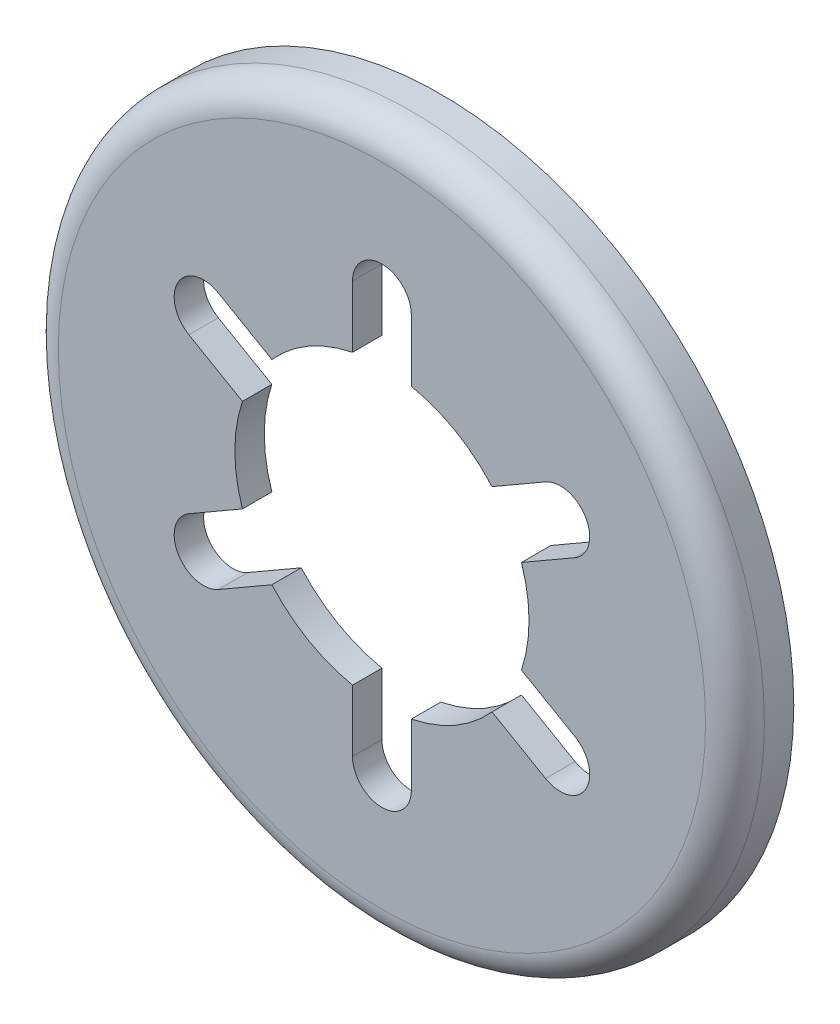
ISO-10303-21;
HEADER;
FILE_DESCRIPTION(('STEP AP214'),'2;1');
FILE_NAME('part.step','',(''),(''),'','','');
FILE_SCHEMA(('AUTOMOTIVE_DESIGN { 1 0 10303 214 1 1 1 1 }'));
ENDSEC;
DATA;
#1=APPLICATION_CONTEXT('core data for automotive mechanical design processes');
#2=APPLICATION_PROTOCOL_DEFINITION('international standard','automotive_design',2000,#1);
#3=PRODUCT_CONTEXT('',#1,'mechanical');
#4=PRODUCT('Part','Part','',(#3));
#5=PRODUCT_RELATED_PRODUCT_CATEGORY('part','',(#4));
#6=PRODUCT_DEFINITION_FORMATION('','',#4);
#7=PRODUCT_DEFINITION_CONTEXT('part definition',#1,'design');
#8=PRODUCT_DEFINITION('design','',#6,#7);
#9=PRODUCT_DEFINITION_SHAPE('','',#8);
#10=(LENGTH_UNIT() NAMED_UNIT(*) SI_UNIT(.MILLI.,.METRE.));
#11=(NAMED_UNIT(*) PLANE_ANGLE_UNIT() SI_UNIT($,.RADIAN.));
#12=(NAMED_UNIT(*) SI_UNIT($,.STERADIAN.) SOLID_ANGLE_UNIT());
#13=UNCERTAINTY_MEASURE_WITH_UNIT(LENGTH_MEASURE(1.E-05),#10,'distance_accuracy_value','');
#14=(GEOMETRIC_REPRESENTATION_CONTEXT(3) GLOBAL_UNCERTAINTY_ASSIGNED_CONTEXT((#13)) GLOBAL_UNIT_ASSIGNED_CONTEXT((#10,
#11,#12)) REPRESENTATION_CONTEXT('',''));
#15=CARTESIAN_POINT('',(0.,0.,0.));
#16=DIRECTION('',(0.,0.,1.));
#17=DIRECTION('',(1.,0.,0.));
#18=AXIS2_PLACEMENT_3D('',#15,#16,#17);
#19=CARTESIAN_POINT('',(0.,0.,1.));
#20=DIRECTION('',(0.,0.,-1.));
#21=DIRECTION('',(-1.,0.,0.));
#22=AXIS2_PLACEMENT_3D('',#19,#20,#21);
#23=CYLINDRICAL_SURFACE('',#22,2.5);
#24=DIRECTION('',(0.,0.,1.));
#25=VECTOR('',#24,1.);
#26=CARTESIAN_POINT('',(-1.87132034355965,1.6577575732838,0.));
#27=LINE('',#26,#25);
#28=CARTESIAN_POINT('',(-1.87132034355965,1.6577575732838,0.5));
#29=VERTEX_POINT('',#28);
#30=CARTESIAN_POINT('',(-1.87132034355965,1.6577575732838,1.));
#31=VERTEX_POINT('',#30);
#32=EDGE_CURVE('E214',#29,#31,#27,.T.);
#33=ORIENTED_EDGE('',*,*,#32,.F.);
#34=CARTESIAN_POINT('',(0.,0.,0.5));
#35=DIRECTION('',(0.,0.,-1.));
#36=DIRECTION('',(-1.,0.,0.));
#37=AXIS2_PLACEMENT_3D('',#34,#35,#36);
#38=CIRCLE('',#37,2.5);
#39=CARTESIAN_POINT('',(-0.5,2.44948974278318,0.5));
#40=VERTEX_POINT('',#39);
#41=EDGE_CURVE('E415',#29,#40,#38,.T.);
#42=ORIENTED_EDGE('',*,*,#41,.T.);
#43=DIRECTION('',(0.,0.,1.));
#44=VECTOR('',#43,1.);
#45=CARTESIAN_POINT('',(-0.5,2.44948974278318,0.));
#46=LINE('',#45,#44);
#47=CARTESIAN_POINT('',(-0.5,2.44948974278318,1.));
#48=VERTEX_POINT('',#47);
#49=EDGE_CURVE('E266',#40,#48,#46,.T.);
#50=ORIENTED_EDGE('',*,*,#49,.T.);
#51=CARTESIAN_POINT('',(0.,0.,1.));
#52=DIRECTION('',(0.,0.,1.));
#53=DIRECTION('',(1.,0.,0.));
#54=AXIS2_PLACEMENT_3D('',#51,#52,#53);
#55=CIRCLE('',#54,2.5);
#56=EDGE_CURVE('E309',#48,#31,#55,.T.);
#57=ORIENTED_EDGE('',*,*,#56,.T.);
#58=EDGE_LOOP('',(#33,#42,#50,#57));
#59=FACE_BOUND('',#58,.T.);
#60=ADVANCED_FACE('F30',(#59),#23,.F.);
#61=DIRECTION('',(0.,0.,1.));
#62=VECTOR('',#61,1.);
#63=CARTESIAN_POINT('',(-2.37132034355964,-0.791732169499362,0.));
#64=LINE('',#63,#62);
#65=CARTESIAN_POINT('',(-2.37132034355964,-0.791732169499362,0.5));
#66=VERTEX_POINT('',#65);
#67=CARTESIAN_POINT('',(-2.37132034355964,-0.791732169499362,1.));
#68=VERTEX_POINT('',#67);
#69=EDGE_CURVE('E207',#66,#68,#64,.T.);
#70=ORIENTED_EDGE('',*,*,#69,.F.);
#71=CARTESIAN_POINT('',(0.,0.,0.5));
#72=DIRECTION('',(0.,0.,-1.));
#73=DIRECTION('',(-1.,0.,0.));
#74=AXIS2_PLACEMENT_3D('',#71,#72,#73);
#75=CIRCLE('',#74,2.5);
#76=CARTESIAN_POINT('',(-2.37132034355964,0.791732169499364,0.5));
#77=VERTEX_POINT('',#76);
#78=EDGE_CURVE('E193',#66,#77,#75,.T.);
#79=ORIENTED_EDGE('',*,*,#78,.T.);
#80=DIRECTION('',(0.,0.,1.));
#81=VECTOR('',#80,1.);
#82=CARTESIAN_POINT('',(-2.37132034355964,0.791732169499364,0.));
#83=LINE('',#82,#81);
#84=CARTESIAN_POINT('',(-2.37132034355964,0.791732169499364,1.));
#85=VERTEX_POINT('',#84);
#86=EDGE_CURVE('E205',#77,#85,#83,.T.);
#87=ORIENTED_EDGE('',*,*,#86,.T.);
#88=EDGE_CURVE('E310',#85,#68,#55,.T.);
#89=ORIENTED_EDGE('',*,*,#88,.T.);
#90=EDGE_LOOP('',(#70,#79,#87,#89));
#91=FACE_BOUND('',#90,.T.);
#92=ADVANCED_FACE('F203',(#91),#23,.F.);
#93=DIRECTION('',(0.,0.,1.));
#94=VECTOR('',#93,1.);
#95=CARTESIAN_POINT('',(-0.5,-2.44948974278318,0.));
#96=LINE('',#95,#94);
#97=CARTESIAN_POINT('',(-0.5,-2.44948974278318,0.5));
#98=VERTEX_POINT('',#97);
#99=CARTESIAN_POINT('',(-0.5,-2.44948974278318,1.));
#100=VERTEX_POINT('',#99);
#101=EDGE_CURVE('E252',#98,#100,#96,.T.);
#102=ORIENTED_EDGE('',*,*,#101,.F.);
#103=CARTESIAN_POINT('',(0.,0.,0.5));
#104=DIRECTION('',(0.,0.,-1.));
#105=DIRECTION('',(-1.,0.,0.));
#106=AXIS2_PLACEMENT_3D('',#103,#104,#105);
#107=CIRCLE('',#106,2.5);
#108=CARTESIAN_POINT('',(-1.87132034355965,-1.6577575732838,0.5));
#109=VERTEX_POINT('',#108);
#110=EDGE_CURVE('E370',#98,#109,#107,.T.);
#111=ORIENTED_EDGE('',*,*,#110,.T.);
#112=DIRECTION('',(0.,0.,1.));
#113=VECTOR('',#112,1.);
#114=CARTESIAN_POINT('',(-1.87132034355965,-1.6577575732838,0.));
#115=LINE('',#114,#113);
#116=CARTESIAN_POINT('',(-1.87132034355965,-1.6577575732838,1.));
#117=VERTEX_POINT('',#116);
#118=EDGE_CURVE('E237',#109,#117,#115,.T.);
#119=ORIENTED_EDGE('',*,*,#118,.T.);
#120=EDGE_CURVE('E346',#117,#100,#55,.T.);
#121=ORIENTED_EDGE('',*,*,#120,.T.);
#122=EDGE_LOOP('',(#102,#111,#119,#121));
#123=FACE_BOUND('',#122,.T.);
#124=ADVANCED_FACE('F357',(#123),#23,.F.);
#125=DIRECTION('',(0.,0.,1.));
#126=VECTOR('',#125,1.);
#127=CARTESIAN_POINT('',(1.87132034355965,-1.6577575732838,0.));
#128=LINE('',#127,#126);
#129=CARTESIAN_POINT('',(1.87132034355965,-1.6577575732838,0.5));
#130=VERTEX_POINT('',#129);
#131=CARTESIAN_POINT('',(1.87132034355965,-1.6577575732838,1.));
#132=VERTEX_POINT('',#131);
#133=EDGE_CURVE('E285',#130,#132,#128,.T.);
#134=ORIENTED_EDGE('',*,*,#133,.F.);
#135=CARTESIAN_POINT('',(0.,0.,0.5));
#136=DIRECTION('',(0.,0.,-1.));
#137=DIRECTION('',(-1.,0.,0.));
#138=AXIS2_PLACEMENT_3D('',#135,#136,#137);
#139=CIRCLE('',#138,2.5);
#140=CARTESIAN_POINT('',(0.5,-2.44948974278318,0.5));
#141=VERTEX_POINT('',#140);
#142=EDGE_CURVE('E386',#130,#141,#139,.T.);
#143=ORIENTED_EDGE('',*,*,#142,.T.);
#144=DIRECTION('',(0.,0.,1.));
#145=VECTOR('',#144,1.);
#146=CARTESIAN_POINT('',(0.5,-2.44948974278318,0.));
#147=LINE('',#146,#145);
#148=CARTESIAN_POINT('',(0.5,-2.44948974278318,1.));
#149=VERTEX_POINT('',#148);
#150=EDGE_CURVE('E254',#141,#149,#147,.T.);
#151=ORIENTED_EDGE('',*,*,#150,.T.);
#152=EDGE_CURVE('E345',#149,#132,#55,.T.);
#153=ORIENTED_EDGE('',*,*,#152,.T.);
#154=EDGE_LOOP('',(#134,#143,#151,#153));
#155=FACE_BOUND('',#154,.T.);
#156=ADVANCED_FACE('F466',(#155),#23,.F.);
#157=DIRECTION('',(0.,0.,1.));
#158=VECTOR('',#157,1.);
#159=CARTESIAN_POINT('',(0.5,2.44948974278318,0.));
#160=LINE('',#159,#158);
#161=CARTESIAN_POINT('',(0.5,2.44948974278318,0.5));
#162=VERTEX_POINT('',#161);
#163=CARTESIAN_POINT('',(0.5,2.44948974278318,1.));
#164=VERTEX_POINT('',#163);
#165=EDGE_CURVE('E265',#162,#164,#160,.T.);
#166=ORIENTED_EDGE('',*,*,#165,.F.);
#167=CARTESIAN_POINT('',(0.,0.,0.5));
#168=DIRECTION('',(0.,0.,-1.));
#169=DIRECTION('',(-1.,0.,0.));
#170=AXIS2_PLACEMENT_3D('',#167,#168,#169);
#171=CIRCLE('',#170,2.5);
#172=CARTESIAN_POINT('',(1.87132034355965,1.6577575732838,0.5));
#173=VERTEX_POINT('',#172);
#174=EDGE_CURVE('E383',#162,#173,#171,.T.);
#175=ORIENTED_EDGE('',*,*,#174,.T.);
#176=DIRECTION('',(0.,0.,1.));
#177=VECTOR('',#176,1.);
#178=CARTESIAN_POINT('',(1.87132034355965,1.6577575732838,0.));
#179=LINE('',#178,#177);
#180=CARTESIAN_POINT('',(1.87132034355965,1.6577575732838,1.));
#181=VERTEX_POINT('',#180);
#182=EDGE_CURVE('E303',#173,#181,#179,.T.);
#183=ORIENTED_EDGE('',*,*,#182,.T.);
#184=EDGE_CURVE('E306',#181,#164,#55,.T.);
#185=ORIENTED_EDGE('',*,*,#184,.T.);
#186=EDGE_LOOP('',(#166,#175,#183,#185));
#187=FACE_BOUND('',#186,.T.);
#188=ADVANCED_FACE('F434',(#187),#23,.F.);
#189=DIRECTION('',(0.,0.,1.));
#190=VECTOR('',#189,1.);
#191=CARTESIAN_POINT('',(2.37132034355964,0.791732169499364,0.));
#192=LINE('',#191,#190);
#193=CARTESIAN_POINT('',(2.37132034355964,0.791732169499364,0.5));
#194=VERTEX_POINT('',#193);
#195=CARTESIAN_POINT('',(2.37132034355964,0.791732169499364,1.));
#196=VERTEX_POINT('',#195);
#197=EDGE_CURVE('E301',#194,#196,#192,.T.);
#198=ORIENTED_EDGE('',*,*,#197,.F.);
#199=CARTESIAN_POINT('',(0.,0.,0.5));
#200=DIRECTION('',(0.,0.,-1.));
#201=DIRECTION('',(-1.,0.,0.));
#202=AXIS2_PLACEMENT_3D('',#199,#200,#201);
#203=CIRCLE('',#202,2.5);
#204=CARTESIAN_POINT('',(2.37132034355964,-0.791732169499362,0.5));
#205=VERTEX_POINT('',#204);
#206=EDGE_CURVE('E401',#194,#205,#203,.T.);
#207=ORIENTED_EDGE('',*,*,#206,.T.);
#208=DIRECTION('',(0.,0.,1.));
#209=VECTOR('',#208,1.);
#210=CARTESIAN_POINT('',(2.37132034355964,-0.791732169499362,0.));
#211=LINE('',#210,#209);
#212=CARTESIAN_POINT('',(2.37132034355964,-0.791732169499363,1.));
#213=VERTEX_POINT('',#212);
#214=EDGE_CURVE('E53',#205,#213,#211,.T.);
#215=ORIENTED_EDGE('',*,*,#214,.T.);
#216=EDGE_CURVE('E300',#213,#196,#55,.T.);
#217=ORIENTED_EDGE('',*,*,#216,.T.);
#218=EDGE_LOOP('',(#198,#207,#215,#217));
#219=FACE_BOUND('',#218,.T.);
#220=ADVANCED_FACE('F454',(#219),#23,.F.);
#221=CARTESIAN_POINT('',(3.03108891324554,1.74999999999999,0.));
#222=DIRECTION('',(0.,0.,1.));
#223=DIRECTION('',(1.,0.,0.));
#224=AXIS2_PLACEMENT_3D('',#221,#222,#223);
#225=CYLINDRICAL_SURFACE('',#224,0.5);
#226=CARTESIAN_POINT('',(3.03108891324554,1.74999999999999,0.5));
#227=DIRECTION('',(0.,0.,-1.));
#228=DIRECTION('',(-1.,0.,0.));
#229=AXIS2_PLACEMENT_3D('',#226,#227,#228);
#230=CIRCLE('',#229,0.5);
#231=CARTESIAN_POINT('',(3.28108891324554,1.31698729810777,0.5));
#232=VERTEX_POINT('',#231);
#233=CARTESIAN_POINT('',(2.78108891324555,2.18301270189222,0.5));
#234=VERTEX_POINT('',#233);
#235=EDGE_CURVE('E395',#232,#234,#230,.F.);
#236=ORIENTED_EDGE('',*,*,#235,.F.);
#237=DIRECTION('',(0.,0.,1.));
#238=VECTOR('',#237,1.);
#239=CARTESIAN_POINT('',(3.28108891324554,1.31698729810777,0.));
#240=LINE('',#239,#238);
#241=CARTESIAN_POINT('',(3.28108891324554,1.31698729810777,1.));
#242=VERTEX_POINT('',#241);
#243=EDGE_CURVE('E298',#232,#242,#240,.T.);
#244=ORIENTED_EDGE('',*,*,#243,.T.);
#245=CARTESIAN_POINT('',(3.03108891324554,1.74999999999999,1.));
#246=DIRECTION('',(0.,0.,1.));
#247=DIRECTION('',(1.,0.,0.));
#248=AXIS2_PLACEMENT_3D('',#245,#246,#247);
#249=CIRCLE('',#248,0.5);
#250=CARTESIAN_POINT('',(2.78108891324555,2.18301270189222,1.));
#251=VERTEX_POINT('',#250);
#252=EDGE_CURVE('E284',#242,#251,#249,.T.);
#253=ORIENTED_EDGE('',*,*,#252,.T.);
#254=DIRECTION('',(0.,0.,1.));
#255=VECTOR('',#254,1.);
#256=CARTESIAN_POINT('',(2.78108891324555,2.18301270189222,0.));
#257=LINE('',#256,#255);
#258=EDGE_CURVE('E297',#234,#251,#257,.T.);
#259=ORIENTED_EDGE('',*,*,#258,.F.);
#260=EDGE_LOOP('',(#236,#244,#253,#259));
#261=FACE_BOUND('',#260,.T.);
#262=ADVANCED_FACE('F445',(#261),#225,.F.);
#263=CARTESIAN_POINT('',(2.37132034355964,0.791732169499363,0.));
#264=DIRECTION('',(0.499999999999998,-0.86602540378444,0.));
#265=DIRECTION('',(0.86602540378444,0.499999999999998,0.));
#266=AXIS2_PLACEMENT_3D('',#263,#264,#265);
#267=PLANE('',#266);
#268=DIRECTION('',(0.86602540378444,0.499999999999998,0.));
#269=VECTOR('',#268,1.);
#270=CARTESIAN_POINT('',(2.37132034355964,0.791732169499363,0.5));
#271=LINE('',#270,#269);
#272=EDGE_CURVE('E399',#194,#232,#271,.T.);
#273=ORIENTED_EDGE('',*,*,#272,.F.);
#274=ORIENTED_EDGE('',*,*,#197,.T.);
#275=DIRECTION('',(0.86602540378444,0.499999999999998,0.));
#276=VECTOR('',#275,1.);
#277=CARTESIAN_POINT('',(2.37132034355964,0.791732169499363,1.));
#278=LINE('',#277,#276);
#279=EDGE_CURVE('E294',#196,#242,#278,.T.);
#280=ORIENTED_EDGE('',*,*,#279,.T.);
#281=ORIENTED_EDGE('',*,*,#243,.F.);
#282=EDGE_LOOP('',(#273,#274,#280,#281));
#283=FACE_BOUND('',#282,.T.);
#284=ADVANCED_FACE('F449',(#283),#267,.F.);
#285=CARTESIAN_POINT('',(1.87132034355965,1.6577575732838,0.));
#286=DIRECTION('',(-0.499999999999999,0.866025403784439,0.));
#287=DIRECTION('',(-0.866025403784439,-0.499999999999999,0.));
#288=AXIS2_PLACEMENT_3D('',#285,#286,#287);
#289=PLANE('',#288);
#290=DIRECTION('',(-0.866025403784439,-0.499999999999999,0.));
#291=VECTOR('',#290,1.);
#292=CARTESIAN_POINT('',(1.87132034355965,1.6577575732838,0.5));
#293=LINE('',#292,#291);
#294=EDGE_CURVE('E393',#234,#173,#293,.T.);
#295=ORIENTED_EDGE('',*,*,#294,.F.);
#296=ORIENTED_EDGE('',*,*,#258,.T.);
#297=DIRECTION('',(-0.866025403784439,-0.499999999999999,0.));
#298=VECTOR('',#297,1.);
#299=CARTESIAN_POINT('',(1.87132034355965,1.6577575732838,1.));
#300=LINE('',#299,#298);
#301=EDGE_CURVE('E291',#251,#181,#300,.T.);
#302=ORIENTED_EDGE('',*,*,#301,.T.);
#303=ORIENTED_EDGE('',*,*,#182,.F.);
#304=EDGE_LOOP('',(#295,#296,#302,#303));
#305=FACE_BOUND('',#304,.T.);
#306=ADVANCED_FACE('F441',(#305),#289,.F.);
#307=CARTESIAN_POINT('',(3.03108891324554,-1.74999999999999,0.));
#308=DIRECTION('',(0.,0.,1.));
#309=DIRECTION('',(1.,0.,0.));
#310=AXIS2_PLACEMENT_3D('',#307,#308,#309);
#311=CYLINDRICAL_SURFACE('',#310,0.5);
#312=CARTESIAN_POINT('',(3.03108891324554,-1.74999999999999,0.5));
#313=DIRECTION('',(0.,0.,-1.));
#314=DIRECTION('',(-1.,0.,0.));
#315=AXIS2_PLACEMENT_3D('',#312,#313,#314);
#316=CIRCLE('',#315,0.5);
#317=CARTESIAN_POINT('',(2.78108891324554,-2.18301270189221,0.5));
#318=VERTEX_POINT('',#317);
#319=CARTESIAN_POINT('',(3.28108891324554,-1.31698729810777,0.5));
#320=VERTEX_POINT('',#319);
#321=EDGE_CURVE('E391',#318,#320,#316,.F.);
#322=ORIENTED_EDGE('',*,*,#321,.F.);
#323=DIRECTION('',(0.,0.,1.));
#324=VECTOR('',#323,1.);
#325=CARTESIAN_POINT('',(2.78108891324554,-2.18301270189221,0.));
#326=LINE('',#325,#324);
#327=CARTESIAN_POINT('',(2.78108891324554,-2.18301270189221,1.));
#328=VERTEX_POINT('',#327);
#329=EDGE_CURVE('E282',#318,#328,#326,.T.);
#330=ORIENTED_EDGE('',*,*,#329,.T.);
#331=CARTESIAN_POINT('',(3.03108891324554,-1.74999999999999,1.));
#332=DIRECTION('',(0.,0.,1.));
#333=DIRECTION('',(1.,0.,0.));
#334=AXIS2_PLACEMENT_3D('',#331,#332,#333);
#335=CIRCLE('',#334,0.5);
#336=CARTESIAN_POINT('',(3.28108891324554,-1.31698729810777,1.));
#337=VERTEX_POINT('',#336);
#338=EDGE_CURVE('E268',#328,#337,#335,.T.);
#339=ORIENTED_EDGE('',*,*,#338,.T.);
#340=DIRECTION('',(0.,0.,1.));
#341=VECTOR('',#340,1.);
#342=CARTESIAN_POINT('',(3.28108891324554,-1.31698729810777,0.));
#343=LINE('',#342,#341);
#344=EDGE_CURVE('E281',#320,#337,#343,.T.);
#345=ORIENTED_EDGE('',*,*,#344,.F.);
#346=EDGE_LOOP('',(#322,#330,#339,#345));
#347=FACE_BOUND('',#346,.T.);
#348=ADVANCED_FACE('F461',(#347),#311,.F.);
#349=CARTESIAN_POINT('',(1.87132034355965,-1.6577575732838,0.));
#350=DIRECTION('',(-0.499999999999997,-0.866025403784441,0.));
#351=DIRECTION('',(0.866025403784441,-0.499999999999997,0.));
#352=AXIS2_PLACEMENT_3D('',#349,#350,#351);
#353=PLANE('',#352);
#354=DIRECTION('',(0.866025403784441,-0.499999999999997,0.));
#355=VECTOR('',#354,1.);
#356=CARTESIAN_POINT('',(1.87132034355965,-1.6577575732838,0.5));
#357=LINE('',#356,#355);
#358=EDGE_CURVE('E389',#130,#318,#357,.T.);
#359=ORIENTED_EDGE('',*,*,#358,.F.);
#360=ORIENTED_EDGE('',*,*,#133,.T.);
#361=DIRECTION('',(0.86602540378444,-0.499999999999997,0.));
#362=VECTOR('',#361,1.);
#363=CARTESIAN_POINT('',(1.87132034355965,-1.6577575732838,1.));
#364=LINE('',#363,#362);
#365=EDGE_CURVE('E278',#132,#328,#364,.T.);
#366=ORIENTED_EDGE('',*,*,#365,.T.);
#367=ORIENTED_EDGE('',*,*,#329,.F.);
#368=EDGE_LOOP('',(#359,#360,#366,#367));
#369=FACE_BOUND('',#368,.T.);
#370=ADVANCED_FACE('F465',(#369),#353,.F.);
#371=CARTESIAN_POINT('',(2.37132034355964,-0.791732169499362,0.));
#372=DIRECTION('',(0.499999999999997,0.86602540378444,0.));
#373=DIRECTION('',(-0.86602540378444,0.499999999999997,0.));
#374=AXIS2_PLACEMENT_3D('',#371,#372,#373);
#375=PLANE('',#374);
#376=DIRECTION('',(-0.86602540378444,0.499999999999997,0.));
#377=VECTOR('',#376,1.);
#378=CARTESIAN_POINT('',(2.37132034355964,-0.791732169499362,0.5));
#379=LINE('',#378,#377);
#380=EDGE_CURVE('E397',#320,#205,#379,.T.);
#381=ORIENTED_EDGE('',*,*,#380,.F.);
#382=ORIENTED_EDGE('',*,*,#344,.T.);
#383=DIRECTION('',(-0.86602540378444,0.499999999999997,0.));
#384=VECTOR('',#383,1.);
#385=CARTESIAN_POINT('',(2.37132034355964,-0.791732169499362,1.));
#386=LINE('',#385,#384);
#387=EDGE_CURVE('E276',#337,#213,#386,.T.);
#388=ORIENTED_EDGE('',*,*,#387,.T.);
#389=ORIENTED_EDGE('',*,*,#214,.F.);
#390=EDGE_LOOP('',(#381,#382,#388,#389));
#391=FACE_BOUND('',#390,.T.);
#392=ADVANCED_FACE('F457',(#391),#375,.F.);
#393=CARTESIAN_POINT('',(-0.5,3.5,0.));
#394=DIRECTION('',(-1.,0.,0.));
#395=DIRECTION('',(0.,-1.,0.));
#396=AXIS2_PLACEMENT_3D('',#393,#394,#395);
#397=PLANE('',#396);
#398=DIRECTION('',(0.,-1.,0.));
#399=VECTOR('',#398,1.);
#400=CARTESIAN_POINT('',(-0.5,3.5,0.5));
#401=LINE('',#400,#399);
#402=CARTESIAN_POINT('',(-0.5,3.5,0.5));
#403=VERTEX_POINT('',#402);
#404=EDGE_CURVE('E374',#403,#40,#401,.T.);
#405=ORIENTED_EDGE('',*,*,#404,.F.);
#406=DIRECTION('',(0.,0.,1.));
#407=VECTOR('',#406,1.);
#408=CARTESIAN_POINT('',(-0.5,3.5,0.));
#409=LINE('',#408,#407);
#410=CARTESIAN_POINT('',(-0.5,3.5,1.));
#411=VERTEX_POINT('',#410);
#412=EDGE_CURVE('E269',#403,#411,#409,.T.);
#413=ORIENTED_EDGE('',*,*,#412,.T.);
#414=DIRECTION('',(0.,-1.,0.));
#415=VECTOR('',#414,1.);
#416=CARTESIAN_POINT('',(-0.5,3.5,1.));
#417=LINE('',#416,#415);
#418=EDGE_CURVE('E262',#411,#48,#417,.T.);
#419=ORIENTED_EDGE('',*,*,#418,.T.);
#420=ORIENTED_EDGE('',*,*,#49,.F.);
#421=EDGE_LOOP('',(#405,#413,#419,#420));
#422=FACE_BOUND('',#421,.T.);
#423=ADVANCED_FACE('F422',(#422),#397,.F.);
#424=CARTESIAN_POINT('',(0.,3.5,0.));
#425=DIRECTION('',(0.,0.,1.));
#426=DIRECTION('',(1.,0.,0.));
#427=AXIS2_PLACEMENT_3D('',#424,#425,#426);
#428=CYLINDRICAL_SURFACE('',#427,0.5);
#429=CARTESIAN_POINT('',(0.,3.5,0.5));
#430=DIRECTION('',(0.,0.,-1.));
#431=DIRECTION('',(-1.,0.,0.));
#432=AXIS2_PLACEMENT_3D('',#429,#430,#431);
#433=CIRCLE('',#432,0.5);
#434=CARTESIAN_POINT('',(0.5,3.5,0.5));
#435=VERTEX_POINT('',#434);
#436=EDGE_CURVE('E372',#435,#403,#433,.F.);
#437=ORIENTED_EDGE('',*,*,#436,.F.);
#438=DIRECTION('',(0.,0.,1.));
#439=VECTOR('',#438,1.);
#440=CARTESIAN_POINT('',(0.5,3.5,0.));
#441=LINE('',#440,#439);
#442=CARTESIAN_POINT('',(0.5,3.5,1.));
#443=VERTEX_POINT('',#442);
#444=EDGE_CURVE('E271',#435,#443,#441,.T.);
#445=ORIENTED_EDGE('',*,*,#444,.T.);
#446=CARTESIAN_POINT('',(0.,3.5,1.));
#447=DIRECTION('',(0.,0.,1.));
#448=DIRECTION('',(1.,0.,0.));
#449=AXIS2_PLACEMENT_3D('',#446,#447,#448);
#450=CIRCLE('',#449,0.5);
#451=EDGE_CURVE('E259',#443,#411,#450,.T.);
#452=ORIENTED_EDGE('',*,*,#451,.T.);
#453=ORIENTED_EDGE('',*,*,#412,.F.);
#454=EDGE_LOOP('',(#437,#445,#452,#453));
#455=FACE_BOUND('',#454,.T.);
#456=ADVANCED_FACE('F427',(#455),#428,.F.);
#457=CARTESIAN_POINT('',(0.5,3.5,0.));
#458=DIRECTION('',(1.,0.,0.));
#459=DIRECTION('',(0.,1.,0.));
#460=AXIS2_PLACEMENT_3D('',#457,#458,#459);
#461=PLANE('',#460);
#462=DIRECTION('',(0.,1.,0.));
#463=VECTOR('',#462,1.);
#464=CARTESIAN_POINT('',(0.5,3.5,0.5));
#465=LINE('',#464,#463);
#466=EDGE_CURVE('E381',#162,#435,#465,.T.);
#467=ORIENTED_EDGE('',*,*,#466,.F.);
#468=ORIENTED_EDGE('',*,*,#165,.T.);
#469=DIRECTION('',(0.,1.,0.));
#470=VECTOR('',#469,1.);
#471=CARTESIAN_POINT('',(0.5,3.5,1.));
#472=LINE('',#471,#470);
#473=EDGE_CURVE('E251',#164,#443,#472,.T.);
#474=ORIENTED_EDGE('',*,*,#473,.T.);
#475=ORIENTED_EDGE('',*,*,#444,.F.);
#476=EDGE_LOOP('',(#467,#468,#474,#475));
#477=FACE_BOUND('',#476,.T.);
#478=ADVANCED_FACE('F431',(#477),#461,.F.);
#479=CARTESIAN_POINT('',(0.,-3.5,0.));
#480=DIRECTION('',(0.,0.,1.));
#481=DIRECTION('',(1.,0.,0.));
#482=AXIS2_PLACEMENT_3D('',#479,#480,#481);
#483=CYLINDRICAL_SURFACE('',#482,0.5);
#484=CARTESIAN_POINT('',(0.,-3.5,0.5));
#485=DIRECTION('',(0.,0.,-1.));
#486=DIRECTION('',(-1.,0.,0.));
#487=AXIS2_PLACEMENT_3D('',#484,#485,#486);
#488=CIRCLE('',#487,0.5);
#489=CARTESIAN_POINT('',(-0.5,-3.5,0.5));
#490=VERTEX_POINT('',#489);
#491=CARTESIAN_POINT('',(0.5,-3.5,0.5));
#492=VERTEX_POINT('',#491);
#493=EDGE_CURVE('E369',#490,#492,#488,.F.);
#494=ORIENTED_EDGE('',*,*,#493,.F.);
#495=DIRECTION('',(0.,0.,1.));
#496=VECTOR('',#495,1.);
#497=CARTESIAN_POINT('',(-0.5,-3.5,0.));
#498=LINE('',#497,#496);
#499=CARTESIAN_POINT('',(-0.5,-3.5,1.));
#500=VERTEX_POINT('',#499);
#501=EDGE_CURVE('E249',#490,#500,#498,.T.);
#502=ORIENTED_EDGE('',*,*,#501,.T.);
#503=CARTESIAN_POINT('',(0.,-3.5,1.));
#504=DIRECTION('',(0.,0.,1.));
#505=DIRECTION('',(1.,0.,0.));
#506=AXIS2_PLACEMENT_3D('',#503,#504,#505);
#507=CIRCLE('',#506,0.5);
#508=CARTESIAN_POINT('',(0.5,-3.5,1.));
#509=VERTEX_POINT('',#508);
#510=EDGE_CURVE('E235',#500,#509,#507,.T.);
#511=ORIENTED_EDGE('',*,*,#510,.T.);
#512=DIRECTION('',(0.,0.,1.));
#513=VECTOR('',#512,1.);
#514=CARTESIAN_POINT('',(0.5,-3.5,0.));
#515=LINE('',#514,#513);
#516=EDGE_CURVE('E248',#492,#509,#515,.T.);
#517=ORIENTED_EDGE('',*,*,#516,.F.);
#518=EDGE_LOOP('',(#494,#502,#511,#517));
#519=FACE_BOUND('',#518,.T.);
#520=ADVANCED_FACE('F473',(#519),#483,.F.);
#521=CARTESIAN_POINT('',(-0.5,-3.5,0.));
#522=DIRECTION('',(-1.,0.,0.));
#523=DIRECTION('',(0.,-1.,0.));
#524=AXIS2_PLACEMENT_3D('',#521,#522,#523);
#525=PLANE('',#524);
#526=DIRECTION('',(0.,-1.,0.));
#527=VECTOR('',#526,1.);
#528=CARTESIAN_POINT('',(-0.5,-3.5,0.5));
#529=LINE('',#528,#527);
#530=EDGE_CURVE('E367',#98,#490,#529,.T.);
#531=ORIENTED_EDGE('',*,*,#530,.F.);
#532=ORIENTED_EDGE('',*,*,#101,.T.);
#533=DIRECTION('',(0.,-1.,0.));
#534=VECTOR('',#533,1.);
#535=CARTESIAN_POINT('',(-0.5,-3.5,1.));
#536=LINE('',#535,#534);
#537=EDGE_CURVE('E245',#100,#500,#536,.T.);
#538=ORIENTED_EDGE('',*,*,#537,.T.);
#539=ORIENTED_EDGE('',*,*,#501,.F.);
#540=EDGE_LOOP('',(#531,#532,#538,#539));
#541=FACE_BOUND('',#540,.T.);
#542=ADVANCED_FACE('F366',(#541),#525,.F.);
#543=CARTESIAN_POINT('',(0.5,-3.5,0.));
#544=DIRECTION('',(1.,0.,0.));
#545=DIRECTION('',(0.,1.,0.));
#546=AXIS2_PLACEMENT_3D('',#543,#544,#545);
#547=PLANE('',#546);
#548=DIRECTION('',(0.,1.,0.));
#549=VECTOR('',#548,1.);
#550=CARTESIAN_POINT('',(0.5,-3.5,0.5));
#551=LINE('',#550,#549);
#552=EDGE_CURVE('E379',#492,#141,#551,.T.);
#553=ORIENTED_EDGE('',*,*,#552,.F.);
#554=ORIENTED_EDGE('',*,*,#516,.T.);
#555=DIRECTION('',(0.,1.,0.));
#556=VECTOR('',#555,1.);
#557=CARTESIAN_POINT('',(0.5,-3.5,1.));
#558=LINE('',#557,#556);
#559=EDGE_CURVE('E242',#509,#149,#558,.T.);
#560=ORIENTED_EDGE('',*,*,#559,.T.);
#561=ORIENTED_EDGE('',*,*,#150,.F.);
#562=EDGE_LOOP('',(#553,#554,#560,#561));
#563=FACE_BOUND('',#562,.T.);
#564=ADVANCED_FACE('F470',(#563),#547,.F.);
#565=CARTESIAN_POINT('',(-3.03108891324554,-1.74999999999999,0.));
#566=DIRECTION('',(0.,0.,1.));
#567=DIRECTION('',(1.,0.,0.));
#568=AXIS2_PLACEMENT_3D('',#565,#566,#567);
#569=CYLINDRICAL_SURFACE('',#568,0.5);
#570=CARTESIAN_POINT('',(-3.03108891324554,-1.74999999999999,0.5));
#571=DIRECTION('',(0.,0.,-1.));
#572=DIRECTION('',(-1.,0.,0.));
#573=AXIS2_PLACEMENT_3D('',#570,#571,#572);
#574=CIRCLE('',#573,0.5);
#575=CARTESIAN_POINT('',(-3.28108891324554,-1.31698729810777,0.5));
#576=VERTEX_POINT('',#575);
#577=CARTESIAN_POINT('',(-2.78108891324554,-2.18301270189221,0.5));
#578=VERTEX_POINT('',#577);
#579=EDGE_CURVE('E410',#576,#578,#574,.F.);
#580=ORIENTED_EDGE('',*,*,#579,.F.);
#581=DIRECTION('',(0.,0.,1.));
#582=VECTOR('',#581,1.);
#583=CARTESIAN_POINT('',(-3.28108891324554,-1.31698729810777,0.));
#584=LINE('',#583,#582);
#585=CARTESIAN_POINT('',(-3.28108891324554,-1.31698729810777,1.));
#586=VERTEX_POINT('',#585);
#587=EDGE_CURVE('E233',#576,#586,#584,.T.);
#588=ORIENTED_EDGE('',*,*,#587,.T.);
#589=CARTESIAN_POINT('',(-3.03108891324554,-1.74999999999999,1.));
#590=DIRECTION('',(0.,0.,1.));
#591=DIRECTION('',(1.,0.,0.));
#592=AXIS2_PLACEMENT_3D('',#589,#590,#591);
#593=CIRCLE('',#592,0.5);
#594=CARTESIAN_POINT('',(-2.78108891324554,-2.18301270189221,1.));
#595=VERTEX_POINT('',#594);
#596=EDGE_CURVE('E223',#586,#595,#593,.T.);
#597=ORIENTED_EDGE('',*,*,#596,.T.);
#598=DIRECTION('',(0.,0.,1.));
#599=VECTOR('',#598,1.);
#600=CARTESIAN_POINT('',(-2.78108891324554,-2.18301270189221,0.));
#601=LINE('',#600,#599);
#602=EDGE_CURVE('E232',#578,#595,#601,.T.);
#603=ORIENTED_EDGE('',*,*,#602,.F.);
#604=EDGE_LOOP('',(#580,#588,#597,#603));
#605=FACE_BOUND('',#604,.T.);
#606=ADVANCED_FACE('F586',(#605),#569,.F.);
#607=CARTESIAN_POINT('',(-2.37132034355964,-0.791732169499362,0.));
#608=DIRECTION('',(-0.499999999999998,0.86602540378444,0.));
#609=DIRECTION('',(-0.86602540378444,-0.499999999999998,0.));
#610=AXIS2_PLACEMENT_3D('',#607,#608,#609);
#611=PLANE('',#610);
#612=DIRECTION('',(-0.86602540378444,-0.499999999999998,0.));
#613=VECTOR('',#612,1.);
#614=CARTESIAN_POINT('',(-2.37132034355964,-0.791732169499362,0.5));
#615=LINE('',#614,#613);
#616=EDGE_CURVE('E408',#66,#576,#615,.T.);
#617=ORIENTED_EDGE('',*,*,#616,.F.);
#618=ORIENTED_EDGE('',*,*,#69,.T.);
#619=DIRECTION('',(-0.86602540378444,-0.499999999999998,0.));
#620=VECTOR('',#619,1.);
#621=CARTESIAN_POINT('',(-2.37132034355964,-0.791732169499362,1.));
#622=LINE('',#621,#620);
#623=EDGE_CURVE('E229',#68,#586,#622,.T.);
#624=ORIENTED_EDGE('',*,*,#623,.T.);
#625=ORIENTED_EDGE('',*,*,#587,.F.);
#626=EDGE_LOOP('',(#617,#618,#624,#625));
#627=FACE_BOUND('',#626,.T.);
#628=ADVANCED_FACE('F578',(#627),#611,.F.);
#629=CARTESIAN_POINT('',(-1.87132034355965,-1.6577575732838,0.));
#630=DIRECTION('',(0.499999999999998,-0.86602540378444,0.));
#631=DIRECTION('',(0.86602540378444,0.499999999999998,0.));
#632=AXIS2_PLACEMENT_3D('',#629,#630,#631);
#633=PLANE('',#632);
#634=DIRECTION('',(0.86602540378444,0.499999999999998,0.));
#635=VECTOR('',#634,1.);
#636=CARTESIAN_POINT('',(-1.87132034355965,-1.6577575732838,0.5));
#637=LINE('',#636,#635);
#638=EDGE_CURVE('E417',#578,#109,#637,.T.);
#639=ORIENTED_EDGE('',*,*,#638,.F.);
#640=ORIENTED_EDGE('',*,*,#602,.T.);
#641=DIRECTION('',(0.86602540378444,0.499999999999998,0.));
#642=VECTOR('',#641,1.);
#643=CARTESIAN_POINT('',(-1.87132034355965,-1.6577575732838,1.));
#644=LINE('',#643,#642);
#645=EDGE_CURVE('E226',#595,#117,#644,.T.);
#646=ORIENTED_EDGE('',*,*,#645,.T.);
#647=ORIENTED_EDGE('',*,*,#118,.F.);
#648=EDGE_LOOP('',(#639,#640,#646,#647));
#649=FACE_BOUND('',#648,.T.);
#650=ADVANCED_FACE('F571',(#649),#633,.F.);
#651=CARTESIAN_POINT('',(-3.03108891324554,1.74999999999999,0.));
#652=DIRECTION('',(0.,0.,1.));
#653=DIRECTION('',(1.,0.,0.));
#654=AXIS2_PLACEMENT_3D('',#651,#652,#653);
#655=CYLINDRICAL_SURFACE('',#654,0.5);
#656=CARTESIAN_POINT('',(-3.03108891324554,1.74999999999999,0.5));
#657=DIRECTION('',(0.,0.,-1.));
#658=DIRECTION('',(-1.,0.,0.));
#659=AXIS2_PLACEMENT_3D('',#656,#657,#658);
#660=CIRCLE('',#659,0.5);
#661=CARTESIAN_POINT('',(-2.78108891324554,2.18301270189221,0.5));
#662=VERTEX_POINT('',#661);
#663=CARTESIAN_POINT('',(-3.28108891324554,1.31698729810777,0.5));
#664=VERTEX_POINT('',#663);
#665=EDGE_CURVE('E45',#662,#664,#660,.F.);
#666=ORIENTED_EDGE('',*,*,#665,.F.);
#667=DIRECTION('',(0.,0.,1.));
#668=VECTOR('',#667,1.);
#669=CARTESIAN_POINT('',(-2.78108891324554,2.18301270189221,0.));
#670=LINE('',#669,#668);
#671=CARTESIAN_POINT('',(-2.78108891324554,2.18301270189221,1.));
#672=VERTEX_POINT('',#671);
#673=EDGE_CURVE('E217',#662,#672,#670,.T.);
#674=ORIENTED_EDGE('',*,*,#673,.T.);
#675=CARTESIAN_POINT('',(-3.03108891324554,1.74999999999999,1.));
#676=DIRECTION('',(0.,0.,1.));
#677=DIRECTION('',(1.,0.,0.));
#678=AXIS2_PLACEMENT_3D('',#675,#676,#677);
#679=CIRCLE('',#678,0.5);
#680=CARTESIAN_POINT('',(-3.28108891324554,1.31698729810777,1.));
#681=VERTEX_POINT('',#680);
#682=EDGE_CURVE('E337',#672,#681,#679,.T.);
#683=ORIENTED_EDGE('',*,*,#682,.T.);
#684=DIRECTION('',(0.,0.,1.));
#685=VECTOR('',#684,1.);
#686=CARTESIAN_POINT('',(-3.28108891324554,1.31698729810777,0.));
#687=LINE('',#686,#685);
#688=EDGE_CURVE('E215',#664,#681,#687,.T.);
#689=ORIENTED_EDGE('',*,*,#688,.F.);
#690=EDGE_LOOP('',(#666,#674,#683,#689));
#691=FACE_BOUND('',#690,.T.);
#692=ADVANCED_FACE('F405',(#691),#655,.F.);
#693=CARTESIAN_POINT('',(-1.87132034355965,1.6577575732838,0.));
#694=DIRECTION('',(0.499999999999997,0.866025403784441,0.));
#695=DIRECTION('',(-0.866025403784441,0.499999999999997,0.));
#696=AXIS2_PLACEMENT_3D('',#693,#694,#695);
#697=PLANE('',#696);
#698=DIRECTION('',(-0.866025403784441,0.499999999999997,0.));
#699=VECTOR('',#698,1.);
#700=CARTESIAN_POINT('',(-1.87132034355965,1.6577575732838,0.5));
#701=LINE('',#700,#699);
#702=EDGE_CURVE('E208',#29,#662,#701,.T.);
#703=ORIENTED_EDGE('',*,*,#702,.F.);
#704=ORIENTED_EDGE('',*,*,#32,.T.);
#705=DIRECTION('',(-0.866025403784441,0.499999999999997,0.));
#706=VECTOR('',#705,1.);
#707=CARTESIAN_POINT('',(-1.87132034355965,1.6577575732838,1.));
#708=LINE('',#707,#706);
#709=EDGE_CURVE('E219',#31,#672,#708,.T.);
#710=ORIENTED_EDGE('',*,*,#709,.T.);
#711=ORIENTED_EDGE('',*,*,#673,.F.);
#712=EDGE_LOOP('',(#703,#704,#710,#711));
#713=FACE_BOUND('',#712,.T.);
#714=ADVANCED_FACE('F407',(#713),#697,.F.);
#715=CARTESIAN_POINT('',(-2.37132034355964,0.791732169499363,0.));
#716=DIRECTION('',(-0.499999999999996,-0.866025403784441,0.));
#717=DIRECTION('',(0.866025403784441,-0.499999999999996,0.));
#718=AXIS2_PLACEMENT_3D('',#715,#716,#717);
#719=PLANE('',#718);
#720=DIRECTION('',(0.866025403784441,-0.499999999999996,0.));
#721=VECTOR('',#720,1.);
#722=CARTESIAN_POINT('',(-2.37132034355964,0.791732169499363,0.5));
#723=LINE('',#722,#721);
#724=EDGE_CURVE('E190',#664,#77,#723,.T.);
#725=ORIENTED_EDGE('',*,*,#724,.F.);
#726=ORIENTED_EDGE('',*,*,#688,.T.);
#727=DIRECTION('',(0.866025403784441,-0.499999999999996,0.));
#728=VECTOR('',#727,1.);
#729=CARTESIAN_POINT('',(-2.37132034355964,0.791732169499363,1.));
#730=LINE('',#729,#728);
#731=EDGE_CURVE('E212',#681,#85,#730,.T.);
#732=ORIENTED_EDGE('',*,*,#731,.T.);
#733=ORIENTED_EDGE('',*,*,#86,.F.);
#734=EDGE_LOOP('',(#725,#726,#732,#733));
#735=FACE_BOUND('',#734,.T.);
#736=ADVANCED_FACE('F210',(#735),#719,.F.);
#737=CARTESIAN_POINT('',(0.,0.,1.));
#738=DIRECTION('',(0.,0.,1.));
#739=DIRECTION('',(1.,0.,0.));
#740=AXIS2_PLACEMENT_3D('',#737,#738,#739);
#741=PLANE('',#740);
#742=CARTESIAN_POINT('',(0.,0.,1.));
#743=DIRECTION('',(0.,0.,1.));
#744=DIRECTION('',(1.,0.,0.));
#745=AXIS2_PLACEMENT_3D('',#742,#743,#744);
#746=CIRCLE('',#745,5.5);
#747=CARTESIAN_POINT('',(5.5,0.,1.));
#748=VERTEX_POINT('',#747);
#749=EDGE_CURVE('E198',#748,#748,#746,.T.);
#750=ORIENTED_EDGE('',*,*,#749,.T.);
#751=EDGE_LOOP('',(#750));
#752=FACE_BOUND('',#751,.T.);
#753=ORIENTED_EDGE('',*,*,#709,.F.);
#754=ORIENTED_EDGE('',*,*,#56,.F.);
#755=ORIENTED_EDGE('',*,*,#418,.F.);
#756=ORIENTED_EDGE('',*,*,#451,.F.);
#757=ORIENTED_EDGE('',*,*,#473,.F.);
#758=ORIENTED_EDGE('',*,*,#184,.F.);
#759=ORIENTED_EDGE('',*,*,#301,.F.);
#760=ORIENTED_EDGE('',*,*,#252,.F.);
#761=ORIENTED_EDGE('',*,*,#279,.F.);
#762=ORIENTED_EDGE('',*,*,#216,.F.);
#763=ORIENTED_EDGE('',*,*,#387,.F.);
#764=ORIENTED_EDGE('',*,*,#338,.F.);
#765=ORIENTED_EDGE('',*,*,#365,.F.);
#766=ORIENTED_EDGE('',*,*,#152,.F.);
#767=ORIENTED_EDGE('',*,*,#559,.F.);
#768=ORIENTED_EDGE('',*,*,#510,.F.);
#769=ORIENTED_EDGE('',*,*,#537,.F.);
#770=ORIENTED_EDGE('',*,*,#120,.F.);
#771=ORIENTED_EDGE('',*,*,#645,.F.);
#772=ORIENTED_EDGE('',*,*,#596,.F.);
#773=ORIENTED_EDGE('',*,*,#623,.F.);
#774=ORIENTED_EDGE('',*,*,#88,.F.);
#775=ORIENTED_EDGE('',*,*,#731,.F.);
#776=ORIENTED_EDGE('',*,*,#682,.F.);
#777=EDGE_LOOP('',(#753,#754,#755,#756,#757,#758,#759,#760,#761,#762,#763,#764,#765,#766,#767,
#768,#769,#770,#771,#772,#773,#774,#775,#776));
#778=FACE_BOUND('',#777,.T.);
#779=ADVANCED_FACE('F326',(#752,#778),#741,.T.);
#780=CARTESIAN_POINT('',(0.,0.,0.));
#781=DIRECTION('',(0.,0.,1.));
#782=DIRECTION('',(1.,0.,0.));
#783=AXIS2_PLACEMENT_3D('',#780,#781,#782);
#784=PLANE('',#783);
#785=CARTESIAN_POINT('',(0.,0.,0.));
#786=DIRECTION('',(0.,0.,-1.));
#787=DIRECTION('',(-1.,0.,0.));
#788=AXIS2_PLACEMENT_3D('',#785,#786,#787);
#789=CIRCLE('',#788,5.5);
#790=CARTESIAN_POINT('',(-5.5,0.,0.));
#791=VERTEX_POINT('',#790);
#792=EDGE_CURVE('E722',#791,#791,#789,.T.);
#793=ORIENTED_EDGE('',*,*,#792,.F.);
#794=EDGE_LOOP('',(#793));
#795=FACE_BOUND('',#794,.T.);
#796=CARTESIAN_POINT('',(0.,0.,0.));
#797=DIRECTION('',(0.,0.,1.));
#798=DIRECTION('',(1.,0.,0.));
#799=AXIS2_PLACEMENT_3D('',#796,#797,#798);
#800=CIRCLE('',#799,6.);
#801=CARTESIAN_POINT('',(6.,0.,0.));
#802=VERTEX_POINT('',#801);
#803=EDGE_CURVE('E199',#802,#802,#800,.T.);
#804=ORIENTED_EDGE('',*,*,#803,.F.);
#805=EDGE_LOOP('',(#804));
#806=FACE_BOUND('',#805,.T.);
#807=ADVANCED_FACE('F329',(#795,#806),#784,.F.);
#808=CARTESIAN_POINT('',(0.,0.,1.));
#809=DIRECTION('',(0.,0.,-1.));
#810=DIRECTION('',(-1.,0.,0.));
#811=AXIS2_PLACEMENT_3D('',#808,#809,#810);
#812=CYLINDRICAL_SURFACE('',#811,6.);
#813=CARTESIAN_POINT('',(0.,0.,0.5));
#814=DIRECTION('',(0.,0.,1.));
#815=DIRECTION('',(1.,0.,0.));
#816=AXIS2_PLACEMENT_3D('',#813,#814,#815);
#817=CIRCLE('',#816,6.);
#818=CARTESIAN_POINT('',(6.,0.,0.5));
#819=VERTEX_POINT('',#818);
#820=EDGE_CURVE('E38',#819,#819,#817,.F.);
#821=ORIENTED_EDGE('',*,*,#820,.T.);
#822=EDGE_LOOP('',(#821));
#823=FACE_BOUND('',#822,.T.);
#824=ORIENTED_EDGE('',*,*,#803,.T.);
#825=EDGE_LOOP('',(#824));
#826=FACE_BOUND('',#825,.T.);
#827=ADVANCED_FACE('F32',(#823,#826),#812,.T.);
#828=CARTESIAN_POINT('',(0.,0.,0.5));
#829=DIRECTION('',(0.,0.,-1.));
#830=DIRECTION('',(-1.,0.,0.));
#831=AXIS2_PLACEMENT_3D('',#828,#829,#830);
#832=PLANE('',#831);
#833=CARTESIAN_POINT('',(0.,0.,0.5));
#834=DIRECTION('',(0.,0.,-1.));
#835=DIRECTION('',(-1.,0.,0.));
#836=AXIS2_PLACEMENT_3D('',#833,#834,#835);
#837=CIRCLE('',#836,5.);
#838=CARTESIAN_POINT('',(-5.,0.,0.5));
#839=VERTEX_POINT('',#838);
#840=EDGE_CURVE('E11',#839,#839,#837,.T.);
#841=ORIENTED_EDGE('',*,*,#840,.T.);
#842=EDGE_LOOP('',(#841));
#843=FACE_BOUND('',#842,.T.);
#844=ORIENTED_EDGE('',*,*,#272,.T.);
#845=ORIENTED_EDGE('',*,*,#235,.T.);
#846=ORIENTED_EDGE('',*,*,#294,.T.);
#847=ORIENTED_EDGE('',*,*,#174,.F.);
#848=ORIENTED_EDGE('',*,*,#466,.T.);
#849=ORIENTED_EDGE('',*,*,#436,.T.);
#850=ORIENTED_EDGE('',*,*,#404,.T.);
#851=ORIENTED_EDGE('',*,*,#41,.F.);
#852=ORIENTED_EDGE('',*,*,#702,.T.);
#853=ORIENTED_EDGE('',*,*,#665,.T.);
#854=ORIENTED_EDGE('',*,*,#724,.T.);
#855=ORIENTED_EDGE('',*,*,#78,.F.);
#856=ORIENTED_EDGE('',*,*,#616,.T.);
#857=ORIENTED_EDGE('',*,*,#579,.T.);
#858=ORIENTED_EDGE('',*,*,#638,.T.);
#859=ORIENTED_EDGE('',*,*,#110,.F.);
#860=ORIENTED_EDGE('',*,*,#530,.T.);
#861=ORIENTED_EDGE('',*,*,#493,.T.);
#862=ORIENTED_EDGE('',*,*,#552,.T.);
#863=ORIENTED_EDGE('',*,*,#142,.F.);
#864=ORIENTED_EDGE('',*,*,#358,.T.);
#865=ORIENTED_EDGE('',*,*,#321,.T.);
#866=ORIENTED_EDGE('',*,*,#380,.T.);
#867=ORIENTED_EDGE('',*,*,#206,.F.);
#868=EDGE_LOOP('',(#844,#845,#846,#847,#848,#849,#850,#851,#852,#853,#854,#855,#856,#857,#858,
#859,#860,#861,#862,#863,#864,#865,#866,#867));
#869=FACE_BOUND('',#868,.T.);
#870=ADVANCED_FACE('F192',(#843,#869),#832,.T.);
#871=CARTESIAN_POINT('',(0.,0.,0.5));
#872=DIRECTION('',(0.,0.,1.));
#873=DIRECTION('',(1.,0.,0.));
#874=AXIS2_PLACEMENT_3D('',#871,#872,#873);
#875=TOROIDAL_SURFACE('',#874,5.5,0.5);
#876=ORIENTED_EDGE('',*,*,#820,.F.);
#877=EDGE_LOOP('',(#876));
#878=FACE_BOUND('',#877,.T.);
#879=ORIENTED_EDGE('',*,*,#749,.F.);
#880=EDGE_LOOP('',(#879));
#881=FACE_BOUND('',#880,.T.);
#882=ADVANCED_FACE('F319',(#878,#881),#875,.T.);
#883=CARTESIAN_POINT('',(0.,0.,0.));
#884=DIRECTION('',(0.,0.,-1.));
#885=DIRECTION('',(-1.,0.,0.));
#886=AXIS2_PLACEMENT_3D('',#883,#884,#885);
#887=TOROIDAL_SURFACE('',#886,5.,0.5);
#888=ORIENTED_EDGE('',*,*,#792,.T.);
#889=EDGE_LOOP('',(#888));
#890=FACE_BOUND('',#889,.T.);
#891=ORIENTED_EDGE('',*,*,#840,.F.);
#892=EDGE_LOOP('',(#891));
#893=FACE_BOUND('',#892,.T.);
#894=ADVANCED_FACE('F322',(#890,#893),#887,.F.);
#895=CLOSED_SHELL('',(#60,#92,#124,#156,#188,#220,#262,#284,#306,#348,#370,#392,#423,#456,#478,
#520,#542,#564,#606,#628,#650,#692,#714,#736,#779,#807,#827,#870,#882,#894));
#896=MANIFOLD_SOLID_BREP('B2',#895);
#897=ADVANCED_BREP_SHAPE_REPRESENTATION('',(#18,#896),#14);
#898=SHAPE_DEFINITION_REPRESENTATION(#9,#897);
ENDSEC;
END-ISO-10303-21;
